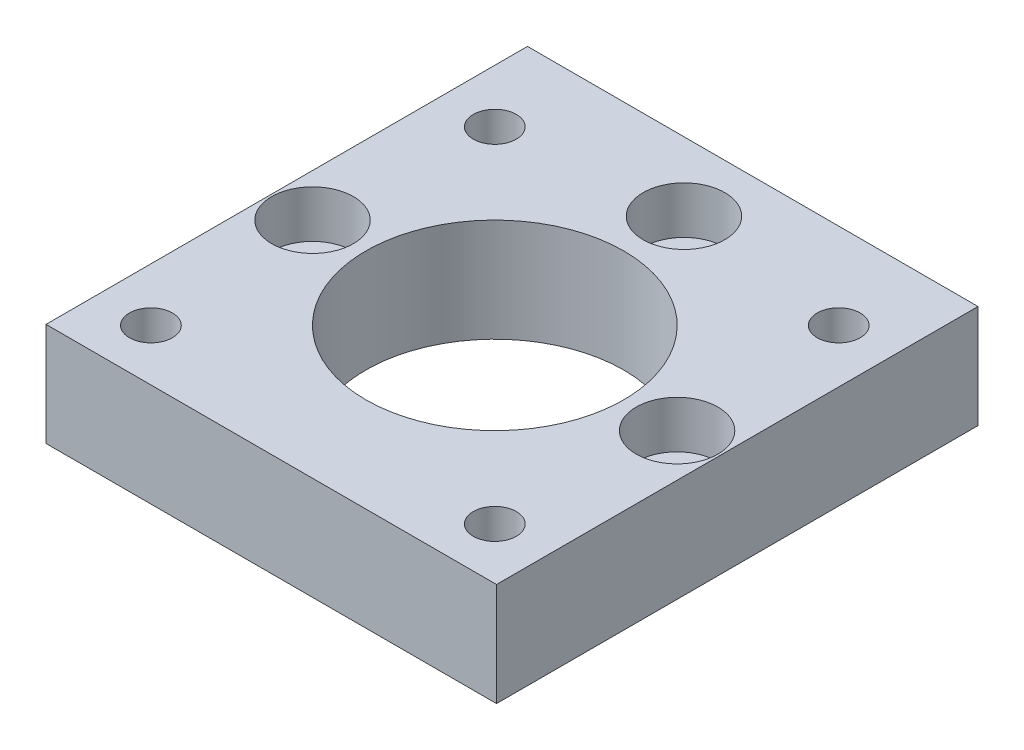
from build123d import *

# Parameters (mm, degrees)
SKETCH_1_W           = 52.4
SKETCH_1_H           = 12
EXTRUDE_1_DEPTH      = 56
SKETCH_2_OUTSIDE_W   = 69.926
SKETCH_2_OUTSIDE_H   = 73.526
SKETCH_2_OUTSIDE_W_2 = 52.4
SKETCH_2_OUTSIDE_H_2 = 56
SKETCH_2_OUTSIDE_R   = 15
SKETCH_2_OUTSIDE_R_2 = 2.5
SKETCH_2_OUTSIDE_R_3 = 2.75
CUT_EXTRUDE_1_DEPTH  = 56
SKETCH_3_R           = 4.75
CUT_EXTRUDE_2_DEPTH  = 5.5


with BuildPart() as part:
    # Sketch 1 → Extrude 1 (new body)
    with BuildSketch(Plane.XY):
        with Locations((26.2, 6)):
            Rectangle(SKETCH_1_W, SKETCH_1_H)
    extrude(amount=EXTRUDE_1_DEPTH)

    # Sketch 2 outside → Cut-Extrude 1 (cut)
    # profile 1 of 9: a face of its own
    with BuildSketch(Plane(origin=(0, 12, 0), x_dir=(1, 0, 0), z_dir=(0, 1, 0))):
        with Locations((26.2, -28)):
            Rectangle(SKETCH_2_OUTSIDE_W, SKETCH_2_OUTSIDE_H)
        with Locations((26.2, -28)):
            Rectangle(SKETCH_2_OUTSIDE_W_2, SKETCH_2_OUTSIDE_H_2, mode=Mode.SUBTRACT)
    # profile 2 of 9: a face of its own
    with BuildSketch(Plane(origin=(0, 12, 0), x_dir=(1, 0, 0), z_dir=(0, 1, 0))):
        with Locations(Location((26.2, -30, 0), (0, 0, 270))):
            Circle(SKETCH_2_OUTSIDE_R)
    # profile 3 of 9: a face of its own
    with BuildSketch(Plane(origin=(0, 12, 0), x_dir=(1, 0, 0), z_dir=(0, 1, 0))):
        with Locations(Location((6.2, -10, 0), (0, 0, 270))):
            Circle(SKETCH_2_OUTSIDE_R_2)
    # profile 4 of 9: a face of its own
    with BuildSketch(Plane(origin=(0, 12, 0), x_dir=(1, 0, 0), z_dir=(0, 1, 0))):
        with Locations(Location((46.2, -10, 0), (0, 0, 270))):
            Circle(SKETCH_2_OUTSIDE_R_2)
    # profile 5 of 9: a face of its own
    with BuildSketch(Plane(origin=(0, 12, 0), x_dir=(1, 0, 0), z_dir=(0, 1, 0))):
        with Locations(Location((46.2, -50, 0), (0, 0, 270))):
            Circle(SKETCH_2_OUTSIDE_R_2)
    # profile 6 of 9: a face of its own
    with BuildSketch(Plane(origin=(0, 12, 0), x_dir=(1, 0, 0), z_dir=(0, 1, 0))):
        with Locations(Location((6.2, -50, 0), (0, 0, 270))):
            Circle(SKETCH_2_OUTSIDE_R_2)
    # profile 7 of 9: a face of its own
    with BuildSketch(Plane(origin=(0, 12, 0), x_dir=(1, 0, 0), z_dir=(0, 1, 0))):
        with Locations(Location((47.4, -30, 0), (0, 0, 270))):
            Circle(SKETCH_2_OUTSIDE_R_3)
    # profile 8 of 9: a face of its own
    with BuildSketch(Plane(origin=(0, 12, 0), x_dir=(1, 0, 0), z_dir=(0, 1, 0))):
        with Locations(Location((5, -30, 0), (0, 0, 270))):
            Circle(SKETCH_2_OUTSIDE_R_3)
    # profile 9 of 9: a face of its own
    with BuildSketch(Plane(origin=(0, 12, 0), x_dir=(1, 0, 0), z_dir=(0, 1, 0))):
        with Locations(Location((26.2, -8, 0), (0, 0, 270))):
            Circle(SKETCH_2_OUTSIDE_R_3)
    extrude(amount=-CUT_EXTRUDE_1_DEPTH, mode=Mode.SUBTRACT)

    # Sketch 3 → Cut-Extrude 2 (cut)
    with BuildSketch(Plane(origin=(0, 12, 0), x_dir=(1, 0, 0), z_dir=(0, 1, 0))):
        with Locations(Location((47.4, -30, 0), (0, 0, 270))):
            Circle(SKETCH_3_R)
        with Locations(Location((5, -30, 0), (0, 0, 270))):
            Circle(SKETCH_3_R)
        with Locations(Location((26.2, -8, 0), (0, 0, 270))):
            Circle(SKETCH_3_R)
    extrude(amount=-CUT_EXTRUDE_2_DEPTH, mode=Mode.SUBTRACT)


solid = part.part
